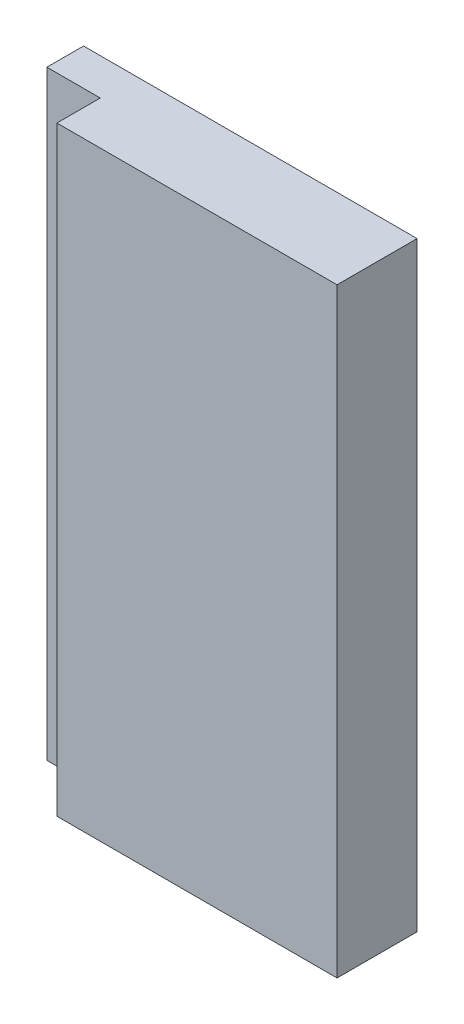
ISO-10303-21;
HEADER;
FILE_DESCRIPTION(('STEP AP214'),'2;1');
FILE_NAME('part.step','',(''),(''),'','','');
FILE_SCHEMA(('AUTOMOTIVE_DESIGN { 1 0 10303 214 1 1 1 1 }'));
ENDSEC;
DATA;
#1=APPLICATION_CONTEXT('core data for automotive mechanical design processes');
#2=APPLICATION_PROTOCOL_DEFINITION('international standard','automotive_design',2000,#1);
#3=PRODUCT_CONTEXT('',#1,'mechanical');
#4=PRODUCT('Part','Part','',(#3));
#5=PRODUCT_RELATED_PRODUCT_CATEGORY('part','',(#4));
#6=PRODUCT_DEFINITION_FORMATION('','',#4);
#7=PRODUCT_DEFINITION_CONTEXT('part definition',#1,'design');
#8=PRODUCT_DEFINITION('design','',#6,#7);
#9=PRODUCT_DEFINITION_SHAPE('','',#8);
#10=(LENGTH_UNIT() NAMED_UNIT(*) SI_UNIT(.MILLI.,.METRE.));
#11=(NAMED_UNIT(*) PLANE_ANGLE_UNIT() SI_UNIT($,.RADIAN.));
#12=(NAMED_UNIT(*) SI_UNIT($,.STERADIAN.) SOLID_ANGLE_UNIT());
#13=UNCERTAINTY_MEASURE_WITH_UNIT(LENGTH_MEASURE(1.E-05),#10,'distance_accuracy_value','');
#14=(GEOMETRIC_REPRESENTATION_CONTEXT(3) GLOBAL_UNCERTAINTY_ASSIGNED_CONTEXT((#13)) GLOBAL_UNIT_ASSIGNED_CONTEXT((#10,
#11,#12)) REPRESENTATION_CONTEXT('',''));
#15=CARTESIAN_POINT('',(0.,0.,0.));
#16=DIRECTION('',(0.,0.,1.));
#17=DIRECTION('',(1.,0.,0.));
#18=AXIS2_PLACEMENT_3D('',#15,#16,#17);
#19=CARTESIAN_POINT('',(20.,40.,6.));
#20=DIRECTION('',(1.,0.,0.));
#21=DIRECTION('',(0.,1.,0.));
#22=AXIS2_PLACEMENT_3D('',#19,#20,#21);
#23=PLANE('',#22);
#24=DIRECTION('',(0.,-1.,0.));
#25=VECTOR('',#24,1.);
#26=CARTESIAN_POINT('',(20.,40.,2.75));
#27=LINE('',#26,#25);
#28=CARTESIAN_POINT('',(20.,40.,2.75));
#29=VERTEX_POINT('',#28);
#30=CARTESIAN_POINT('',(20.,-5.,2.75));
#31=VERTEX_POINT('',#30);
#32=EDGE_CURVE('E81',#29,#31,#27,.T.);
#33=ORIENTED_EDGE('',*,*,#32,.F.);
#34=DIRECTION('',(0.,0.,-1.));
#35=VECTOR('',#34,1.);
#36=CARTESIAN_POINT('',(20.,40.,6.));
#37=LINE('',#36,#35);
#38=CARTESIAN_POINT('',(20.,40.,0.));
#39=VERTEX_POINT('',#38);
#40=EDGE_CURVE('E94',#29,#39,#37,.T.);
#41=ORIENTED_EDGE('',*,*,#40,.T.);
#42=DIRECTION('',(0.,-1.,0.));
#43=VECTOR('',#42,1.);
#44=CARTESIAN_POINT('',(20.,40.,0.));
#45=LINE('',#44,#43);
#46=CARTESIAN_POINT('',(20.,-5.,0.));
#47=VERTEX_POINT('',#46);
#48=EDGE_CURVE('E91',#39,#47,#45,.T.);
#49=ORIENTED_EDGE('',*,*,#48,.T.);
#50=DIRECTION('',(0.,0.,-1.));
#51=VECTOR('',#50,1.);
#52=CARTESIAN_POINT('',(20.,-5.,6.));
#53=LINE('',#52,#51);
#54=EDGE_CURVE('E11',#31,#47,#53,.T.);
#55=ORIENTED_EDGE('',*,*,#54,.F.);
#56=EDGE_LOOP('',(#33,#41,#49,#55));
#57=FACE_BOUND('',#56,.T.);
#58=ADVANCED_FACE('F26',(#57),#23,.F.);
#59=CARTESIAN_POINT('',(20.,-5.,6.));
#60=DIRECTION('',(0.,1.,0.));
#61=DIRECTION('',(0.,0.,1.));
#62=AXIS2_PLACEMENT_3D('',#59,#60,#61);
#63=PLANE('',#62);
#64=DIRECTION('',(1.,0.,0.));
#65=VECTOR('',#64,1.);
#66=CARTESIAN_POINT('',(20.,-5.,6.));
#67=LINE('',#66,#65);
#68=CARTESIAN_POINT('',(24.,-5.,6.));
#69=VERTEX_POINT('',#68);
#70=CARTESIAN_POINT('',(45.,-5.,6.));
#71=VERTEX_POINT('',#70);
#72=EDGE_CURVE('E98',#69,#71,#67,.T.);
#73=ORIENTED_EDGE('',*,*,#72,.F.);
#74=DIRECTION('',(0.,0.,1.));
#75=VECTOR('',#74,1.);
#76=CARTESIAN_POINT('',(24.,-5.,2.75));
#77=LINE('',#76,#75);
#78=CARTESIAN_POINT('',(24.,-5.,2.75));
#79=VERTEX_POINT('',#78);
#80=EDGE_CURVE('E40',#79,#69,#77,.T.);
#81=ORIENTED_EDGE('',*,*,#80,.F.);
#82=DIRECTION('',(1.,0.,0.));
#83=VECTOR('',#82,1.);
#84=CARTESIAN_POINT('',(20.,-5.,2.75));
#85=LINE('',#84,#83);
#86=EDGE_CURVE('E125',#31,#79,#85,.T.);
#87=ORIENTED_EDGE('',*,*,#86,.F.);
#88=ORIENTED_EDGE('',*,*,#54,.T.);
#89=DIRECTION('',(1.,0.,0.));
#90=VECTOR('',#89,1.);
#91=CARTESIAN_POINT('',(20.,-5.,0.));
#92=LINE('',#91,#90);
#93=CARTESIAN_POINT('',(45.,-5.,0.));
#94=VERTEX_POINT('',#93);
#95=EDGE_CURVE('E114',#47,#94,#92,.T.);
#96=ORIENTED_EDGE('',*,*,#95,.T.);
#97=DIRECTION('',(0.,0.,-1.));
#98=VECTOR('',#97,1.);
#99=CARTESIAN_POINT('',(45.,-5.,6.));
#100=LINE('',#99,#98);
#101=EDGE_CURVE('E33',#71,#94,#100,.T.);
#102=ORIENTED_EDGE('',*,*,#101,.F.);
#103=EDGE_LOOP('',(#73,#81,#87,#88,#96,#102));
#104=FACE_BOUND('',#103,.T.);
#105=ADVANCED_FACE('F122',(#104),#63,.F.);
#106=CARTESIAN_POINT('',(45.,40.,6.));
#107=DIRECTION('',(-1.,0.,0.));
#108=DIRECTION('',(0.,-1.,0.));
#109=AXIS2_PLACEMENT_3D('',#106,#107,#108);
#110=PLANE('',#109);
#111=DIRECTION('',(0.,1.,0.));
#112=VECTOR('',#111,1.);
#113=CARTESIAN_POINT('',(45.,40.,0.));
#114=LINE('',#113,#112);
#115=CARTESIAN_POINT('',(45.,40.,0.));
#116=VERTEX_POINT('',#115);
#117=EDGE_CURVE('E107',#94,#116,#114,.T.);
#118=ORIENTED_EDGE('',*,*,#117,.T.);
#119=DIRECTION('',(0.,0.,-1.));
#120=VECTOR('',#119,1.);
#121=CARTESIAN_POINT('',(45.,40.,6.));
#122=LINE('',#121,#120);
#123=CARTESIAN_POINT('',(45.,40.,6.));
#124=VERTEX_POINT('',#123);
#125=EDGE_CURVE('E96',#124,#116,#122,.T.);
#126=ORIENTED_EDGE('',*,*,#125,.F.);
#127=DIRECTION('',(0.,1.,0.));
#128=VECTOR('',#127,1.);
#129=CARTESIAN_POINT('',(45.,40.,6.));
#130=LINE('',#129,#128);
#131=EDGE_CURVE('E48',#71,#124,#130,.T.);
#132=ORIENTED_EDGE('',*,*,#131,.F.);
#133=ORIENTED_EDGE('',*,*,#101,.T.);
#134=EDGE_LOOP('',(#118,#126,#132,#133));
#135=FACE_BOUND('',#134,.T.);
#136=ADVANCED_FACE('F106',(#135),#110,.F.);
#137=CARTESIAN_POINT('',(20.,40.,6.));
#138=DIRECTION('',(0.,-1.,0.));
#139=DIRECTION('',(0.,0.,-1.));
#140=AXIS2_PLACEMENT_3D('',#137,#138,#139);
#141=PLANE('',#140);
#142=DIRECTION('',(-1.,0.,0.));
#143=VECTOR('',#142,1.);
#144=CARTESIAN_POINT('',(20.,40.,2.75));
#145=LINE('',#144,#143);
#146=CARTESIAN_POINT('',(24.,40.,2.75));
#147=VERTEX_POINT('',#146);
#148=EDGE_CURVE('E90',#147,#29,#145,.T.);
#149=ORIENTED_EDGE('',*,*,#148,.F.);
#150=DIRECTION('',(0.,0.,1.));
#151=VECTOR('',#150,1.);
#152=CARTESIAN_POINT('',(24.,40.,2.75));
#153=LINE('',#152,#151);
#154=CARTESIAN_POINT('',(24.,40.,6.));
#155=VERTEX_POINT('',#154);
#156=EDGE_CURVE('E78',#147,#155,#153,.T.);
#157=ORIENTED_EDGE('',*,*,#156,.T.);
#158=DIRECTION('',(-1.,0.,0.));
#159=VECTOR('',#158,1.);
#160=CARTESIAN_POINT('',(20.,40.,6.));
#161=LINE('',#160,#159);
#162=EDGE_CURVE('E88',#124,#155,#161,.T.);
#163=ORIENTED_EDGE('',*,*,#162,.F.);
#164=ORIENTED_EDGE('',*,*,#125,.T.);
#165=DIRECTION('',(-1.,0.,0.));
#166=VECTOR('',#165,1.);
#167=CARTESIAN_POINT('',(20.,40.,0.));
#168=LINE('',#167,#166);
#169=EDGE_CURVE('E117',#116,#39,#168,.T.);
#170=ORIENTED_EDGE('',*,*,#169,.T.);
#171=ORIENTED_EDGE('',*,*,#40,.F.);
#172=EDGE_LOOP('',(#149,#157,#163,#164,#170,#171));
#173=FACE_BOUND('',#172,.T.);
#174=ADVANCED_FACE('F86',(#173),#141,.F.);
#175=CARTESIAN_POINT('',(20.,40.,6.));
#176=DIRECTION('',(0.,0.,1.));
#177=DIRECTION('',(1.,0.,0.));
#178=AXIS2_PLACEMENT_3D('',#175,#176,#177);
#179=PLANE('',#178);
#180=DIRECTION('',(0.,1.,0.));
#181=VECTOR('',#180,1.);
#182=CARTESIAN_POINT('',(24.,40.,6.));
#183=LINE('',#182,#181);
#184=EDGE_CURVE('E75',#69,#155,#183,.T.);
#185=ORIENTED_EDGE('',*,*,#184,.F.);
#186=ORIENTED_EDGE('',*,*,#72,.T.);
#187=ORIENTED_EDGE('',*,*,#131,.T.);
#188=ORIENTED_EDGE('',*,*,#162,.T.);
#189=EDGE_LOOP('',(#185,#186,#187,#188));
#190=FACE_BOUND('',#189,.T.);
#191=ADVANCED_FACE('F93',(#190),#179,.T.);
#192=CARTESIAN_POINT('',(20.,40.,0.));
#193=DIRECTION('',(0.,0.,1.));
#194=DIRECTION('',(1.,0.,0.));
#195=AXIS2_PLACEMENT_3D('',#192,#193,#194);
#196=PLANE('',#195);
#197=ORIENTED_EDGE('',*,*,#48,.F.);
#198=ORIENTED_EDGE('',*,*,#169,.F.);
#199=ORIENTED_EDGE('',*,*,#117,.F.);
#200=ORIENTED_EDGE('',*,*,#95,.F.);
#201=EDGE_LOOP('',(#197,#198,#199,#200));
#202=FACE_BOUND('',#201,.T.);
#203=ADVANCED_FACE('F113',(#202),#196,.F.);
#204=CARTESIAN_POINT('',(24.,40.,2.75));
#205=DIRECTION('',(1.,0.,0.));
#206=DIRECTION('',(0.,1.,0.));
#207=AXIS2_PLACEMENT_3D('',#204,#205,#206);
#208=PLANE('',#207);
#209=ORIENTED_EDGE('',*,*,#184,.T.);
#210=ORIENTED_EDGE('',*,*,#156,.F.);
#211=DIRECTION('',(0.,1.,0.));
#212=VECTOR('',#211,1.);
#213=CARTESIAN_POINT('',(24.,40.,2.75));
#214=LINE('',#213,#212);
#215=EDGE_CURVE('E128',#79,#147,#214,.T.);
#216=ORIENTED_EDGE('',*,*,#215,.F.);
#217=ORIENTED_EDGE('',*,*,#80,.T.);
#218=EDGE_LOOP('',(#209,#210,#216,#217));
#219=FACE_BOUND('',#218,.T.);
#220=ADVANCED_FACE('F77',(#219),#208,.F.);
#221=CARTESIAN_POINT('',(20.,-5.,2.75));
#222=DIRECTION('',(0.,0.,1.));
#223=DIRECTION('',(1.,0.,0.));
#224=AXIS2_PLACEMENT_3D('',#221,#222,#223);
#225=PLANE('',#224);
#226=ORIENTED_EDGE('',*,*,#32,.T.);
#227=ORIENTED_EDGE('',*,*,#86,.T.);
#228=ORIENTED_EDGE('',*,*,#215,.T.);
#229=ORIENTED_EDGE('',*,*,#148,.T.);
#230=EDGE_LOOP('',(#226,#227,#228,#229));
#231=FACE_BOUND('',#230,.T.);
#232=ADVANCED_FACE('F136',(#231),#225,.T.);
#233=CLOSED_SHELL('',(#58,#105,#136,#174,#191,#203,#220,#232));
#234=MANIFOLD_SOLID_BREP('B2',#233);
#235=ADVANCED_BREP_SHAPE_REPRESENTATION('',(#18,#234),#14);
#236=SHAPE_DEFINITION_REPRESENTATION(#9,#235);
ENDSEC;
END-ISO-10303-21;
